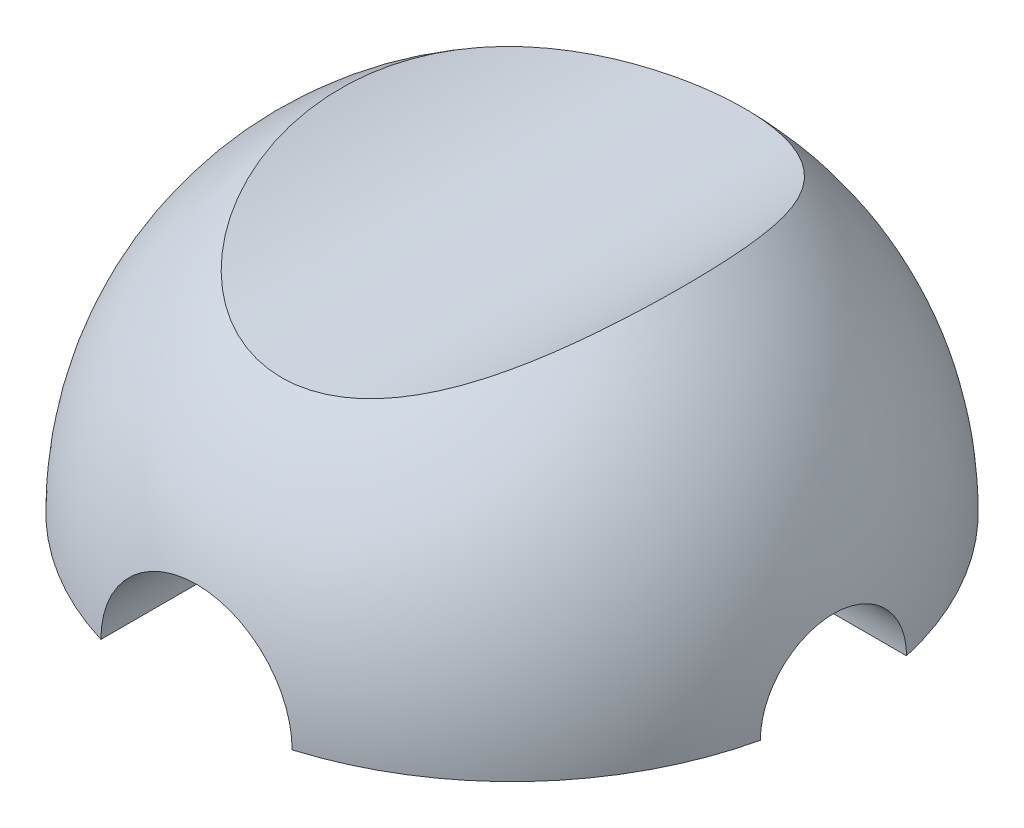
ISO-10303-21;
HEADER;
FILE_DESCRIPTION(('STEP AP214'),'2;1');
FILE_NAME('part.step','',(''),(''),'','','');
FILE_SCHEMA(('AUTOMOTIVE_DESIGN { 1 0 10303 214 1 1 1 1 }'));
ENDSEC;
DATA;
#1=APPLICATION_CONTEXT('core data for automotive mechanical design processes');
#2=APPLICATION_PROTOCOL_DEFINITION('international standard','automotive_design',2000,#1);
#3=PRODUCT_CONTEXT('',#1,'mechanical');
#4=PRODUCT('Part','Part','',(#3));
#5=PRODUCT_RELATED_PRODUCT_CATEGORY('part','',(#4));
#6=PRODUCT_DEFINITION_FORMATION('','',#4);
#7=PRODUCT_DEFINITION_CONTEXT('part definition',#1,'design');
#8=PRODUCT_DEFINITION('design','',#6,#7);
#9=PRODUCT_DEFINITION_SHAPE('','',#8);
#10=(LENGTH_UNIT() NAMED_UNIT(*) SI_UNIT(.MILLI.,.METRE.));
#11=(NAMED_UNIT(*) PLANE_ANGLE_UNIT() SI_UNIT($,.RADIAN.));
#12=(NAMED_UNIT(*) SI_UNIT($,.STERADIAN.) SOLID_ANGLE_UNIT());
#13=UNCERTAINTY_MEASURE_WITH_UNIT(LENGTH_MEASURE(1.E-05),#10,'distance_accuracy_value','');
#14=(GEOMETRIC_REPRESENTATION_CONTEXT(3) GLOBAL_UNCERTAINTY_ASSIGNED_CONTEXT((#13)) GLOBAL_UNIT_ASSIGNED_CONTEXT((#10,
#11,#12)) REPRESENTATION_CONTEXT('',''));
#15=CARTESIAN_POINT('',(0.,0.,0.));
#16=DIRECTION('',(0.,0.,1.));
#17=DIRECTION('',(1.,0.,0.));
#18=AXIS2_PLACEMENT_3D('',#15,#16,#17);
#19=CARTESIAN_POINT('',(-24.1796923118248,0.,-60.8720928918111));
#20=DIRECTION('',(0.,0.,1.));
#21=DIRECTION('',(1.,0.,0.));
#22=AXIS2_PLACEMENT_3D('',#19,#20,#21);
#23=CYLINDRICAL_SURFACE('',#22,11.6016133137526);
#24=CARTESIAN_POINT('',(-24.1796923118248,0.,4.55312467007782));
#25=DIRECTION('',(0.,0.,-1.));
#26=DIRECTION('',(-1.,0.,0.));
#27=AXIS2_PLACEMENT_3D('',#24,#25,#26);
#28=CIRCLE('',#27,11.6016133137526);
#29=CARTESIAN_POINT('',(-12.5780789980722,0.,4.55312467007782));
#30=VERTEX_POINT('',#29);
#31=CARTESIAN_POINT('',(-35.7813056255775,0.,4.55312467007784));
#32=VERTEX_POINT('',#31);
#33=EDGE_CURVE('E160',#30,#32,#28,.F.);
#34=ORIENTED_EDGE('',*,*,#33,.F.);
#35=DIRECTION('',(0.,0.,1.));
#36=VECTOR('',#35,1.);
#37=CARTESIAN_POINT('',(-12.5780789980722,0.,-60.8720928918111));
#38=LINE('',#37,#36);
#39=CARTESIAN_POINT('',(-12.5780789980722,0.,17.4084840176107));
#40=VERTEX_POINT('',#39);
#41=EDGE_CURVE('E153',#30,#40,#38,.T.);
#42=ORIENTED_EDGE('',*,*,#41,.T.);
#43=CARTESIAN_POINT('',(-24.1796923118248,0.,17.4084840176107));
#44=DIRECTION('',(0.,0.,-1.));
#45=DIRECTION('',(-1.,0.,0.));
#46=AXIS2_PLACEMENT_3D('',#43,#44,#45);
#47=CIRCLE('',#46,11.6016133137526);
#48=CARTESIAN_POINT('',(-35.7813056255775,0.,17.4084840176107));
#49=VERTEX_POINT('',#48);
#50=EDGE_CURVE('E59',#49,#40,#47,.T.);
#51=ORIENTED_EDGE('',*,*,#50,.F.);
#52=DIRECTION('',(0.,0.,1.));
#53=VECTOR('',#52,1.);
#54=CARTESIAN_POINT('',(-35.7813056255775,0.,-60.8720928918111));
#55=LINE('',#54,#53);
#56=EDGE_CURVE('E149',#49,#32,#55,.F.);
#57=ORIENTED_EDGE('',*,*,#56,.T.);
#58=EDGE_LOOP('',(#34,#42,#51,#57));
#59=FACE_BOUND('',#58,.T.);
#60=ADVANCED_FACE('F36',(#59),#23,.F.);
#61=CARTESIAN_POINT('',(-24.1796923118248,0.,-46.2973104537));
#62=DIRECTION('',(0.,0.,1.));
#63=DIRECTION('',(1.,0.,0.));
#64=AXIS2_PLACEMENT_3D('',#61,#62,#63);
#65=CIRCLE('',#64,11.6016133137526);
#66=CARTESIAN_POINT('',(-35.7813056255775,0.,-46.2973104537));
#67=VERTEX_POINT('',#66);
#68=CARTESIAN_POINT('',(-12.5780789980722,0.,-46.2973104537));
#69=VERTEX_POINT('',#68);
#70=EDGE_CURVE('E114',#67,#69,#65,.F.);
#71=ORIENTED_EDGE('',*,*,#70,.F.);
#72=CARTESIAN_POINT('',(-35.7813056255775,0.,-59.1526698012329));
#73=VERTEX_POINT('',#72);
#74=EDGE_CURVE('E113',#67,#73,#55,.F.);
#75=ORIENTED_EDGE('',*,*,#74,.T.);
#76=CARTESIAN_POINT('',(-24.1796923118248,0.,-59.1526698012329));
#77=DIRECTION('',(0.,0.,1.));
#78=DIRECTION('',(1.,0.,0.));
#79=AXIS2_PLACEMENT_3D('',#76,#77,#78);
#80=CIRCLE('',#79,11.6016133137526);
#81=CARTESIAN_POINT('',(-12.5780789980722,0.,-59.1526698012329));
#82=VERTEX_POINT('',#81);
#83=EDGE_CURVE('E121',#82,#73,#80,.T.);
#84=ORIENTED_EDGE('',*,*,#83,.F.);
#85=EDGE_CURVE('E45',#82,#69,#38,.T.);
#86=ORIENTED_EDGE('',*,*,#85,.T.);
#87=EDGE_LOOP('',(#71,#75,#84,#86));
#88=FACE_BOUND('',#87,.T.);
#89=ADVANCED_FACE('F202',(#88),#23,.F.);
#90=CARTESIAN_POINT('',(-64.1796923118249,0.,-20.8720928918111));
#91=DIRECTION('',(1.,0.,0.));
#92=DIRECTION('',(0.,0.,-1.));
#93=AXIS2_PLACEMENT_3D('',#90,#91,#92);
#94=CYLINDRICAL_SURFACE('',#93,8.87181817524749);
#95=CARTESIAN_POINT('',(2.32181635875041,0.,-20.8720928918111));
#96=DIRECTION('',(-1.,0.,0.));
#97=DIRECTION('',(0.,0.,1.));
#98=AXIS2_PLACEMENT_3D('',#95,#96,#97);
#99=CIRCLE('',#98,8.87181817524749);
#100=CARTESIAN_POINT('',(2.32181635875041,0.,-29.7439110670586));
#101=VERTEX_POINT('',#100);
#102=CARTESIAN_POINT('',(2.32181635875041,0.,-12.0002747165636));
#103=VERTEX_POINT('',#102);
#104=EDGE_CURVE('E187',#101,#103,#99,.F.);
#105=ORIENTED_EDGE('',*,*,#104,.F.);
#106=DIRECTION('',(1.,0.,0.));
#107=VECTOR('',#106,1.);
#108=CARTESIAN_POINT('',(-64.1796923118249,-2.79318507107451E-13,-29.7439110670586));
#109=LINE('',#108,#107);
#110=CARTESIAN_POINT('',(14.8240362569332,0.,-29.7439110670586));
#111=VERTEX_POINT('',#110);
#112=EDGE_CURVE('E182',#101,#111,#109,.T.);
#113=ORIENTED_EDGE('',*,*,#112,.T.);
#114=CARTESIAN_POINT('',(14.8240362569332,0.,-20.8720928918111));
#115=DIRECTION('',(-1.,0.,0.));
#116=DIRECTION('',(0.,0.,1.));
#117=AXIS2_PLACEMENT_3D('',#114,#115,#116);
#118=CIRCLE('',#117,8.87181817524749);
#119=CARTESIAN_POINT('',(14.8240362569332,0.,-12.0002747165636));
#120=VERTEX_POINT('',#119);
#121=EDGE_CURVE('E123',#120,#111,#118,.T.);
#122=ORIENTED_EDGE('',*,*,#121,.F.);
#123=DIRECTION('',(1.,0.,0.));
#124=VECTOR('',#123,1.);
#125=CARTESIAN_POINT('',(-64.1796923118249,-2.79318507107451E-13,-12.0002747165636));
#126=LINE('',#125,#124);
#127=EDGE_CURVE('E167',#120,#103,#126,.F.);
#128=ORIENTED_EDGE('',*,*,#127,.T.);
#129=EDGE_LOOP('',(#105,#113,#122,#128));
#130=FACE_BOUND('',#129,.T.);
#131=ADVANCED_FACE('F206',(#130),#94,.F.);
#132=CARTESIAN_POINT('',(-50.6812009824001,0.,-20.8720928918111));
#133=DIRECTION('',(1.,0.,0.));
#134=DIRECTION('',(0.,0.,-1.));
#135=AXIS2_PLACEMENT_3D('',#132,#133,#134);
#136=CIRCLE('',#135,8.87181817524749);
#137=CARTESIAN_POINT('',(-50.6812009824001,-2.79318507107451E-13,-12.0002747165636));
#138=VERTEX_POINT('',#137);
#139=CARTESIAN_POINT('',(-50.6812009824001,0.,-29.7439110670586));
#140=VERTEX_POINT('',#139);
#141=EDGE_CURVE('E11',#138,#140,#136,.F.);
#142=ORIENTED_EDGE('',*,*,#141,.F.);
#143=DIRECTION('',(1.,0.,0.));
#144=VECTOR('',#143,1.);
#145=CARTESIAN_POINT('',(-64.1796923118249,-2.79318507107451E-13,-12.0002747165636));
#146=LINE('',#145,#144);
#147=CARTESIAN_POINT('',(-63.1834208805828,0.,-12.0002747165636));
#148=VERTEX_POINT('',#147);
#149=EDGE_CURVE('E119',#138,#148,#146,.F.);
#150=ORIENTED_EDGE('',*,*,#149,.T.);
#151=CARTESIAN_POINT('',(-63.1834208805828,0.,-20.8720928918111));
#152=DIRECTION('',(1.,0.,0.));
#153=DIRECTION('',(0.,0.,-1.));
#154=AXIS2_PLACEMENT_3D('',#151,#152,#153);
#155=CIRCLE('',#154,8.87181817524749);
#156=CARTESIAN_POINT('',(-63.1834208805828,0.,-29.7439110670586));
#157=VERTEX_POINT('',#156);
#158=EDGE_CURVE('E118',#157,#148,#155,.T.);
#159=ORIENTED_EDGE('',*,*,#158,.F.);
#160=DIRECTION('',(1.,0.,0.));
#161=VECTOR('',#160,1.);
#162=CARTESIAN_POINT('',(-64.1796923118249,-2.79318507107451E-13,-29.7439110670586));
#163=LINE('',#162,#161);
#164=EDGE_CURVE('E111',#157,#140,#163,.T.);
#165=ORIENTED_EDGE('',*,*,#164,.T.);
#166=EDGE_LOOP('',(#142,#150,#159,#165));
#167=FACE_BOUND('',#166,.T.);
#168=ADVANCED_FACE('F116',(#167),#94,.F.);
#169=CARTESIAN_POINT('',(-24.1796923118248,0.,-20.8720928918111));
#170=DIRECTION('',(0.,-1.,0.));
#171=DIRECTION('',(0.,0.,1.));
#172=AXIS2_PLACEMENT_3D('',#169,#170,#171);
#173=PLANE('',#172);
#174=ORIENTED_EDGE('',*,*,#112,.F.);
#175=CARTESIAN_POINT('',(-24.1796923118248,0.,-20.8720928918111));
#176=DIRECTION('',(0.,-1.,0.));
#177=DIRECTION('',(1.,0.,0.));
#178=AXIS2_PLACEMENT_3D('',#175,#176,#177);
#179=CIRCLE('',#178,27.94707712);
#180=EDGE_CURVE('E189',#101,#69,#179,.F.);
#181=ORIENTED_EDGE('',*,*,#180,.T.);
#182=ORIENTED_EDGE('',*,*,#85,.F.);
#183=CARTESIAN_POINT('',(-24.1796923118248,0.,-20.8720928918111));
#184=DIRECTION('',(0.,-1.,0.));
#185=DIRECTION('',(0.,0.,1.));
#186=AXIS2_PLACEMENT_3D('',#183,#184,#185);
#187=CIRCLE('',#186,40.);
#188=EDGE_CURVE('E136',#82,#111,#187,.T.);
#189=ORIENTED_EDGE('',*,*,#188,.T.);
#190=EDGE_LOOP('',(#174,#181,#182,#189));
#191=FACE_BOUND('',#190,.T.);
#192=ADVANCED_FACE('F180',(#191),#173,.T.);
#193=ORIENTED_EDGE('',*,*,#74,.F.);
#194=CARTESIAN_POINT('',(-24.1796923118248,0.,-20.8720928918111));
#195=DIRECTION('',(0.,-1.,0.));
#196=DIRECTION('',(1.,0.,0.));
#197=AXIS2_PLACEMENT_3D('',#194,#195,#196);
#198=CIRCLE('',#197,27.94707712);
#199=EDGE_CURVE('E101',#67,#140,#198,.F.);
#200=ORIENTED_EDGE('',*,*,#199,.T.);
#201=ORIENTED_EDGE('',*,*,#164,.F.);
#202=EDGE_CURVE('E170',#157,#73,#187,.T.);
#203=ORIENTED_EDGE('',*,*,#202,.T.);
#204=EDGE_LOOP('',(#193,#200,#201,#203));
#205=FACE_BOUND('',#204,.T.);
#206=ADVANCED_FACE('F109',(#205),#173,.T.);
#207=ORIENTED_EDGE('',*,*,#41,.F.);
#208=CARTESIAN_POINT('',(-24.1796923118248,0.,-20.8720928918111));
#209=DIRECTION('',(0.,-1.,0.));
#210=DIRECTION('',(1.,0.,0.));
#211=AXIS2_PLACEMENT_3D('',#208,#209,#210);
#212=CIRCLE('',#211,27.94707712);
#213=EDGE_CURVE('E191',#30,#103,#212,.F.);
#214=ORIENTED_EDGE('',*,*,#213,.T.);
#215=ORIENTED_EDGE('',*,*,#127,.F.);
#216=EDGE_CURVE('E135',#120,#40,#187,.T.);
#217=ORIENTED_EDGE('',*,*,#216,.T.);
#218=EDGE_LOOP('',(#207,#214,#215,#217));
#219=FACE_BOUND('',#218,.T.);
#220=ADVANCED_FACE('F165',(#219),#173,.T.);
#221=CARTESIAN_POINT('',(-24.1796923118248,0.,-20.8720928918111));
#222=DIRECTION('',(0.,0.,-1.));
#223=DIRECTION('',(-1.,0.,0.));
#224=AXIS2_PLACEMENT_3D('',#221,#222,#223);
#225=SPHERICAL_SURFACE('',#224,40.);
#226=ORIENTED_EDGE('',*,*,#216,.F.);
#227=ORIENTED_EDGE('',*,*,#121,.T.);
#228=ORIENTED_EDGE('',*,*,#188,.F.);
#229=ORIENTED_EDGE('',*,*,#83,.T.);
#230=ORIENTED_EDGE('',*,*,#202,.F.);
#231=ORIENTED_EDGE('',*,*,#158,.T.);
#232=EDGE_CURVE('E174',#49,#148,#187,.T.);
#233=ORIENTED_EDGE('',*,*,#232,.F.);
#234=ORIENTED_EDGE('',*,*,#50,.T.);
#235=EDGE_LOOP('',(#226,#227,#228,#229,#230,#231,#233,#234));
#236=FACE_BOUND('',#235,.T.);
#237=CARTESIAN_POINT('',(-3.37883012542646,34.1661255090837,-20.8720928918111));
#238=CARTESIAN_POINT('',(-3.37882887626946,34.166122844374,-19.9619423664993));
#239=CARTESIAN_POINT('',(-3.40778227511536,34.1473641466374,-19.0517512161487));
#240=CARTESIAN_POINT('',(-3.52403356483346,34.0727942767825,-17.2365634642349));
#241=CARTESIAN_POINT('',(-3.61133595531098,34.0169802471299,-16.3315672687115));
#242=CARTESIAN_POINT('',(-3.84574669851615,33.8696364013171,-14.5310297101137));
#243=CARTESIAN_POINT('',(-3.99293363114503,33.7780596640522,-13.6355023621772));
#244=CARTESIAN_POINT('',(-4.34925660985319,33.5616359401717,-11.8609281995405));
#245=CARTESIAN_POINT('',(-4.55838997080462,33.4367903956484,-10.9818806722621));
#246=CARTESIAN_POINT('',(-5.04307878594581,33.156436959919,-9.24101190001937));
#247=CARTESIAN_POINT('',(-5.31904944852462,33.0007385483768,-8.37933631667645));
#248=CARTESIAN_POINT('',(-5.9404342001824,32.6639118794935,-6.68618698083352));
#249=CARTESIAN_POINT('',(-6.28586103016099,32.4827789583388,-5.85471880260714));
#250=CARTESIAN_POINT('',(-7.04939416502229,32.1016227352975,-4.23247061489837));
#251=CARTESIAN_POINT('',(-7.46734426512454,31.9016404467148,-3.44160779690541));
#252=CARTESIAN_POINT('',(-8.38041382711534,31.4900851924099,-1.90912717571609));
#253=CARTESIAN_POINT('',(-8.87548376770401,31.2785197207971,-1.16747820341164));
#254=CARTESIAN_POINT('',(-9.74824696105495,30.9316641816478,-0.00827610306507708));
#255=CARTESIAN_POINT('',(-10.1017621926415,30.7970614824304,0.427811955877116));
#256=CARTESIAN_POINT('',(-10.8413312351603,30.5295890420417,1.27209176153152));
#257=CARTESIAN_POINT('',(-11.2273805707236,30.3967190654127,1.68028733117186));
#258=CARTESIAN_POINT('',(-12.0316575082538,30.1357729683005,2.46441455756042));
#259=CARTESIAN_POINT('',(-12.449849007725,30.0076917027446,2.84038143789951));
#260=CARTESIAN_POINT('',(-13.3182474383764,29.7593121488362,3.55625692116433));
#261=CARTESIAN_POINT('',(-13.7684500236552,29.6390128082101,3.89617040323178));
#262=CARTESIAN_POINT('',(-14.6243214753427,29.4280109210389,4.48378656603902));
#263=CARTESIAN_POINT('',(-15.0254512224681,29.3356651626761,4.73751749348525));
#264=CARTESIAN_POINT('',(-15.8479157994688,29.1607032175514,5.21369375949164));
#265=CARTESIAN_POINT('',(-16.2692486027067,29.0780860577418,5.4361422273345));
#266=CARTESIAN_POINT('',(-17.1301419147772,28.9244837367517,5.84702788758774));
#267=CARTESIAN_POINT('',(-17.5696980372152,28.8534957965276,6.03547320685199));
#268=CARTESIAN_POINT('',(-18.4646492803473,28.7248647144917,6.37591187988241));
#269=CARTESIAN_POINT('',(-18.9200445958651,28.6672217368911,6.5279047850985));
#270=CARTESIAN_POINT('',(-19.8461016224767,28.5664991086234,6.7939695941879));
#271=CARTESIAN_POINT('',(-20.3168328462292,28.523500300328,6.90783093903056));
#272=CARTESIAN_POINT('',(-21.2675354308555,28.4536613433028,7.09475183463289));
#273=CARTESIAN_POINT('',(-21.7475068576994,28.4268213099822,7.16781109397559));
#274=CARTESIAN_POINT('',(-22.7125094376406,28.3900235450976,7.27199610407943));
#275=CARTESIAN_POINT('',(-23.1975393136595,28.380061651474,7.30313219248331));
#276=CARTESIAN_POINT('',(-24.1684966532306,28.3772326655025,7.32308915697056));
#277=CARTESIAN_POINT('',(-24.6544240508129,28.3843643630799,7.31191302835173));
#278=CARTESIAN_POINT('',(-25.578269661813,28.4139956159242,7.2505527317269));
#279=CARTESIAN_POINT('',(-26.0164864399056,28.4350187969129,7.20405723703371));
#280=CARTESIAN_POINT('',(-26.8871048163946,28.4903492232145,7.07722138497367));
#281=CARTESIAN_POINT('',(-27.3195068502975,28.5246554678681,6.99688357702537));
#282=CARTESIAN_POINT('',(-28.175705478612,28.6057102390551,6.80351882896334));
#283=CARTESIAN_POINT('',(-28.5995023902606,28.6524583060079,6.69049309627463));
#284=CARTESIAN_POINT('',(-29.436063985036,28.7573268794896,6.43323589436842));
#285=CARTESIAN_POINT('',(-29.8488281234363,28.8154479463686,6.28900288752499));
#286=CARTESIAN_POINT('',(-30.674375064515,28.9438678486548,5.9659146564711));
#287=CARTESIAN_POINT('',(-31.0867257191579,29.0145000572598,5.78608960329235));
#288=CARTESIAN_POINT('',(-31.8955396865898,29.1650711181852,5.39711691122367));
#289=CARTESIAN_POINT('',(-32.2920031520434,29.2450098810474,5.18796955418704));
#290=CARTESIAN_POINT('',(-33.0677393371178,29.4126731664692,4.74244240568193));
#291=CARTESIAN_POINT('',(-33.4470066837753,29.5004000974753,4.50605418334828));
#292=CARTESIAN_POINT('',(-34.1872175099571,29.6820688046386,4.00825119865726));
#293=CARTESIAN_POINT('',(-34.5481574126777,29.7760117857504,3.7468315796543));
#294=CARTESIAN_POINT('',(-35.3981276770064,30.008903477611,3.0868153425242));
#295=CARTESIAN_POINT('',(-35.877532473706,30.1502306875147,2.67660308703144));
#296=CARTESIAN_POINT('',(-36.7969206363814,30.4381666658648,1.81581514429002));
#297=CARTESIAN_POINT('',(-37.236891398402,30.5847771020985,1.36522664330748));
#298=CARTESIAN_POINT('',(-38.0778653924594,30.8796916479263,0.428237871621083));
#299=CARTESIAN_POINT('',(-38.4788033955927,31.0279981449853,-0.0582200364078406));
#300=CARTESIAN_POINT('',(-39.2413209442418,31.3226223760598,-1.06150164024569));
#301=CARTESIAN_POINT('',(-39.6028995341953,31.4689400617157,-1.57832607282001));
#302=CARTESIAN_POINT('',(-40.3866037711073,31.7981407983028,-2.79144395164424));
#303=CARTESIAN_POINT('',(-40.7960118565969,31.9793653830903,-3.49642518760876));
#304=CARTESIAN_POINT('',(-41.5532427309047,32.327849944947,-4.94204341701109));
#305=CARTESIAN_POINT('',(-41.9010480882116,32.495105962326,-5.68269042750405));
#306=CARTESIAN_POINT('',(-42.5376517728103,32.8110366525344,-7.19298744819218));
#307=CARTESIAN_POINT('',(-42.8264286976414,32.9597045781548,-7.96264785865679));
#308=CARTESIAN_POINT('',(-43.3472419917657,33.2345936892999,-9.52469051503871));
#309=CARTESIAN_POINT('',(-43.5792821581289,33.3608163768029,-10.3170712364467));
#310=CARTESIAN_POINT('',(-43.9921270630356,33.5896681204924,-11.9322451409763));
#311=CARTESIAN_POINT('',(-44.1720457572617,33.691884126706,-12.7553226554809));
#312=CARTESIAN_POINT('',(-44.4774272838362,33.8676943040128,-14.4144973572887));
#313=CARTESIAN_POINT('',(-44.6028896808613,33.9412882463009,-15.2505946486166));
#314=CARTESIAN_POINT('',(-44.8007238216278,34.0582204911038,-16.9312646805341));
#315=CARTESIAN_POINT('',(-44.8730871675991,34.1015540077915,-17.7758387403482));
#316=CARTESIAN_POINT('',(-44.965490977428,34.1570082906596,-19.4688828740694));
#317=CARTESIAN_POINT('',(-44.9855281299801,34.1691270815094,-20.3173531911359));
#318=CARTESIAN_POINT('',(-44.97258418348,34.1613173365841,-22.1429498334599));
#319=CARTESIAN_POINT('',(-44.931072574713,34.1362322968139,-23.1200095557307));
#320=CARTESIAN_POINT('',(-44.7782641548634,34.0449462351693,-25.066874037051));
#321=CARTESIAN_POINT('',(-44.6669563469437,33.978738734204,-26.0366776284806));
#322=CARTESIAN_POINT('',(-44.3729157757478,33.8071339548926,-27.9620338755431));
#323=CARTESIAN_POINT('',(-44.1901754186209,33.7017325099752,-28.9175850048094));
#324=CARTESIAN_POINT('',(-43.7507428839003,33.4549375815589,-30.8066968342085));
#325=CARTESIAN_POINT('',(-43.494068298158,33.3135526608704,-31.740262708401));
#326=CARTESIAN_POINT('',(-42.9597094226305,33.0292899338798,-33.402191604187));
#327=CARTESIAN_POINT('',(-42.6953319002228,32.8918225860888,-34.1357795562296));
#328=CARTESIAN_POINT('',(-42.1138424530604,32.599399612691,-35.578258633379));
#329=CARTESIAN_POINT('',(-41.7967318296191,32.4444444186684,-36.287150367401));
#330=CARTESIAN_POINT('',(-41.1080288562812,32.1210263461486,-37.6737543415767));
#331=CARTESIAN_POINT('',(-40.7365005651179,31.9525794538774,-38.35150202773));
#332=CARTESIAN_POINT('',(-39.9366521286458,31.6065690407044,-39.670156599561));
#333=CARTESIAN_POINT('',(-39.5083467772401,31.4290079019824,-40.3110730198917));
#334=CARTESIAN_POINT('',(-38.6999309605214,31.1119539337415,-41.4044207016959));
#335=CARTESIAN_POINT('',(-38.3318357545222,30.9732285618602,-41.8659798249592));
#336=CARTESIAN_POINT('',(-37.5608116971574,30.6963344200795,-42.7592558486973));
#337=CARTESIAN_POINT('',(-37.1578851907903,30.5581656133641,-43.1909747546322));
#338=CARTESIAN_POINT('',(-36.3174728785,30.2855455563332,-44.0200196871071));
#339=CARTESIAN_POINT('',(-35.8800195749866,30.1510909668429,-44.4173773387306));
#340=CARTESIAN_POINT('',(-35.1983679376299,29.9546670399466,-44.9842973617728));
#341=CARTESIAN_POINT('',(-34.9669126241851,29.8900705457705,-45.168412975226));
#342=CARTESIAN_POINT('',(-34.4955533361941,29.7630355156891,-45.5264305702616));
#343=CARTESIAN_POINT('',(-34.2556471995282,29.7005975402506,-45.7003299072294));
#344=CARTESIAN_POINT('',(-33.6118895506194,29.5393302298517,-46.1447562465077));
#345=CARTESIAN_POINT('',(-33.2011022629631,29.4427009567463,-46.4061390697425));
#346=CARTESIAN_POINT('',(-32.3589269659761,29.258526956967,-46.8967866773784));
#347=CARTESIAN_POINT('',(-31.9275430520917,29.1709804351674,-47.1260578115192));
#348=CARTESIAN_POINT('',(-31.0460013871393,29.0069676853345,-47.5497129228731));
#349=CARTESIAN_POINT('',(-30.595847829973,28.9304989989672,-47.7441046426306));
#350=CARTESIAN_POINT('',(-29.6791240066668,28.7905417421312,-48.0953696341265));
#351=CARTESIAN_POINT('',(-29.2125535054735,28.7270533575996,-48.2522423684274));
#352=CARTESIAN_POINT('',(-28.2630203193,28.6144336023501,-48.5269229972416));
#353=CARTESIAN_POINT('',(-27.7799716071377,28.5653970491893,-48.6444735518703));
#354=CARTESIAN_POINT('',(-26.8040727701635,28.4837018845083,-48.8370778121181));
#355=CARTESIAN_POINT('',(-26.3112225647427,28.4510434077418,-48.9121311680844));
#356=CARTESIAN_POINT('',(-25.3201602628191,28.4031714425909,-49.0182831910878));
#357=CARTESIAN_POINT('',(-24.821950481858,28.387950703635,-49.0494001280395));
#358=CARTESIAN_POINT('',(-23.8245386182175,28.3754853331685,-49.0670297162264));
#359=CARTESIAN_POINT('',(-23.3253366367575,28.3782389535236,-49.0535467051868));
#360=CARTESIAN_POINT('',(-22.3841339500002,28.4004406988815,-48.9859528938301));
#361=CARTESIAN_POINT('',(-21.9417570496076,28.4180609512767,-48.9363688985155));
#362=CARTESIAN_POINT('',(-21.0631229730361,28.4672117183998,-48.8024151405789));
#363=CARTESIAN_POINT('',(-20.6268652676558,28.4987410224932,-48.7180484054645));
#364=CARTESIAN_POINT('',(-19.7634759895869,28.5749912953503,-48.5156267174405));
#365=CARTESIAN_POINT('',(-19.3363436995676,28.619711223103,-48.3975744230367));
#366=CARTESIAN_POINT('',(-18.4938161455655,28.7213412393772,-48.1292648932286));
#367=CARTESIAN_POINT('',(-18.0784213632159,28.7782518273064,-47.9790063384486));
#368=CARTESIAN_POINT('',(-17.2584774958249,28.9035180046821,-47.6467932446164));
#369=CARTESIAN_POINT('',(-16.8540380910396,28.9719592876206,-47.4646009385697));
#370=CARTESIAN_POINT('',(-16.0613079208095,29.118544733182,-47.0713930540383));
#371=CARTESIAN_POINT('',(-15.6730167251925,29.1966886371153,-46.8603782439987));
#372=CARTESIAN_POINT('',(-14.9139124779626,29.3611813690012,-46.4116222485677));
#373=CARTESIAN_POINT('',(-14.5431038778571,29.4475322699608,-46.1738743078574));
#374=CARTESIAN_POINT('',(-13.8200536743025,29.6268707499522,-45.6738623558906));
#375=CARTESIAN_POINT('',(-13.4678157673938,29.7198596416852,-45.4115934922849));
#376=CARTESIAN_POINT('',(-12.640303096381,29.9506027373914,-44.7510978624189));
#377=CARTESIAN_POINT('',(-12.1746660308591,30.0909130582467,-44.3416341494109));
#378=CARTESIAN_POINT('',(-11.2828490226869,30.3774904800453,-43.4836656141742));
#379=CARTESIAN_POINT('',(-10.8566818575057,30.5237594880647,-43.0351482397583));
#380=CARTESIAN_POINT('',(-10.0430890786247,30.8185745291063,-42.1035956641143));
#381=CARTESIAN_POINT('',(-9.65573189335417,30.9671240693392,-41.6205019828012));
#382=CARTESIAN_POINT('',(-8.91989937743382,31.2627008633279,-40.6252507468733));
#383=CARTESIAN_POINT('',(-8.57142505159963,31.4097280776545,-40.1130924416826));
#384=CARTESIAN_POINT('',(-7.80811618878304,31.7448180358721,-38.8981448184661));
#385=CARTESIAN_POINT('',(-7.40705417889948,31.9311849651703,-38.1862107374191));
#386=CARTESIAN_POINT('',(-6.66716558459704,32.2897332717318,-36.7272549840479));
#387=CARTESIAN_POINT('',(-6.32835876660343,32.4619101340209,-35.9802222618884));
#388=CARTESIAN_POINT('',(-5.70976599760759,32.7870804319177,-34.4577836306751));
#389=CARTESIAN_POINT('',(-5.43000528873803,32.9400656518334,-33.6823657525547));
#390=CARTESIAN_POINT('',(-4.92675491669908,33.2226842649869,-32.1095030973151));
#391=CARTESIAN_POINT('',(-4.70325958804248,33.3523200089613,-31.31206054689));
#392=CARTESIAN_POINT('',(-4.3156876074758,33.5816747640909,-29.7238572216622));
#393=CARTESIAN_POINT('',(-4.15006615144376,33.6821569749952,-28.9335815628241));
#394=CARTESIAN_POINT('',(-3.8675287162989,33.8559370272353,-27.3414630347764));
#395=CARTESIAN_POINT('',(-3.75061185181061,33.9292353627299,-26.5396203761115));
#396=CARTESIAN_POINT('',(-3.56415207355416,34.047084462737,-24.928713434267));
#397=CARTESIAN_POINT('',(-3.49458904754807,34.09164743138,-24.119652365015));
#398=CARTESIAN_POINT('',(-3.40192732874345,34.1511699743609,-22.4977694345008));
#399=CARTESIAN_POINT('',(-3.37883124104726,34.1661278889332,-21.6849473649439));
#400=CARTESIAN_POINT('',(-3.37883012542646,34.1661255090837,-20.8720928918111));
#401=B_SPLINE_CURVE_WITH_KNOTS('',3,(#237,#238,#239,#240,#241,#242,#243,#244,#245,#246,#247,
#248,#249,#250,#251,#252,#253,#254,#255,#256,#257,#258,#259,#260,#261,#262,#263,#264,#265,#266,
#267,#268,#269,#270,#271,#272,#273,#274,#275,#276,#277,#278,#279,#280,#281,#282,#283,#284,#285,
#286,#287,#288,#289,#290,#291,#292,#293,#294,#295,#296,#297,#298,#299,#300,#301,#302,#303,#304,
#305,#306,#307,#308,#309,#310,#311,#312,#313,#314,#315,#316,#317,#318,#319,#320,#321,#322,#323,
#324,#325,#326,#327,#328,#329,#330,#331,#332,#333,#334,#335,#336,#337,#338,#339,#340,#341,#342,
#343,#344,#345,#346,#347,#348,#349,#350,#351,#352,#353,#354,#355,#356,#357,#358,#359,#360,#361,
#362,#363,#364,#365,#366,#367,#368,#369,#370,#371,#372,#373,#374,#375,#376,#377,#378,#379,#380,
#381,#382,#383,#384,#385,#386,#387,#388,#389,#390,#391,#392,#393,#394,#395,#396,#397,#398,#399,
#400),.UNSPECIFIED.,.T.,.F.,(4,2,2,2,2,2,2,2,2,2,2,2,2,2,2,2,2,2,2,2,2,2,2,2,2,2,2,2,2,2,2,2,2,
2,2,2,2,2,2,2,2,2,2,2,2,2,2,2,2,2,2,2,2,2,2,2,2,2,2,2,2,2,2,2,2,2,2,2,2,2,2,2,2,2,2,2,2,2,2,2,2,
4),(0.,2.72986531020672,5.45994115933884,8.19361100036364,10.9271623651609,13.6781515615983,
16.4296458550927,19.1752857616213,21.9191698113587,23.6496671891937,25.3799269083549,
27.1082708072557,28.8363805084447,30.2855886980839,31.7346518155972,33.1833681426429,
34.6321022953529,36.0887091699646,37.545326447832,39.001584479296,40.4577394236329,
41.7797387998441,43.1016386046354,44.4234895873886,45.7454057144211,47.1101246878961,
48.4748305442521,49.8399599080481,51.2053546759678,53.1422894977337,55.0798412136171,
57.020577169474,58.9613602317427,61.4632420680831,63.9658307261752,66.4693251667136,
68.972652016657,71.516325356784,74.0600190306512,76.6041149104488,79.1483717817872,
82.0797343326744,85.011558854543,87.943695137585,90.8751343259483,93.2483901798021,
95.621587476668,97.9920132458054,100.361822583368,102.179585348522,103.997225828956,
105.813175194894,106.721096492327,107.629251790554,109.116867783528,110.604189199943,
112.091180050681,113.578192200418,115.074753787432,116.571327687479,118.067279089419,
119.563085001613,120.89797134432,122.232741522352,123.567406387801,124.902125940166,
126.247241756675,127.592321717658,128.937742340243,130.283429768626,132.187846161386,
134.092876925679,136.001209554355,137.909591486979,140.42034070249,142.931885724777,
145.444502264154,147.956865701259,150.395849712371,152.834789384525,155.27269253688,
157.710732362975),.UNSPECIFIED.);
#402=CARTESIAN_POINT('',(-3.37883012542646,34.1661255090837,-20.8720928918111));
#403=VERTEX_POINT('',#402);
#404=EDGE_CURVE('E130',#403,#403,#401,.T.);
#405=ORIENTED_EDGE('',*,*,#404,.T.);
#406=EDGE_LOOP('',(#405));
#407=FACE_BOUND('',#406,.T.);
#408=ADVANCED_FACE('F38',(#236,#407),#225,.T.);
#409=ORIENTED_EDGE('',*,*,#149,.F.);
#410=CARTESIAN_POINT('',(-24.1796923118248,0.,-20.8720928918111));
#411=DIRECTION('',(0.,-1.,0.));
#412=DIRECTION('',(1.,0.,0.));
#413=AXIS2_PLACEMENT_3D('',#410,#411,#412);
#414=CIRCLE('',#413,27.94707712);
#415=EDGE_CURVE('E51',#138,#32,#414,.F.);
#416=ORIENTED_EDGE('',*,*,#415,.T.);
#417=ORIENTED_EDGE('',*,*,#56,.F.);
#418=ORIENTED_EDGE('',*,*,#232,.T.);
#419=EDGE_LOOP('',(#409,#416,#417,#418));
#420=FACE_BOUND('',#419,.T.);
#421=ADVANCED_FACE('F142',(#420),#173,.T.);
#422=CARTESIAN_POINT('',(-44.9805544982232,34.1661255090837,-60.8720928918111));
#423=CARTESIAN_POINT('',(-32.600950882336,26.7052420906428,-60.8720928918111));
#424=CARTESIAN_POINT('',(-15.7179763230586,26.1974392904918,-60.8720928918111));
#425=CARTESIAN_POINT('',(-3.37883012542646,34.1661255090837,-60.8720928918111));
#426=B_SPLINE_CURVE_WITH_KNOTS('',3,(#422,#423,#424,#425),.UNSPECIFIED.,.F.,.F.,(4,4),(0.,1.),.UNSPECIFIED.);
#427=DIRECTION('',(0.,0.,1.));
#428=VECTOR('',#427,1.);
#429=SURFACE_OF_LINEAR_EXTRUSION('',#426,#428);
#430=ORIENTED_EDGE('',*,*,#404,.F.);
#431=EDGE_LOOP('',(#430));
#432=FACE_BOUND('',#431,.T.);
#433=ADVANCED_FACE('F138',(#432),#429,.F.);
#434=CARTESIAN_POINT('',(-24.1796923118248,-1.6884588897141E-13,-20.8720928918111));
#435=DIRECTION('',(0.,0.,-1.));
#436=DIRECTION('',(-1.,0.,0.));
#437=AXIS2_PLACEMENT_3D('',#434,#435,#436);
#438=SPHERICAL_SURFACE('',#437,27.94707712);
#439=ORIENTED_EDGE('',*,*,#104,.T.);
#440=ORIENTED_EDGE('',*,*,#213,.F.);
#441=ORIENTED_EDGE('',*,*,#33,.T.);
#442=ORIENTED_EDGE('',*,*,#415,.F.);
#443=ORIENTED_EDGE('',*,*,#141,.T.);
#444=ORIENTED_EDGE('',*,*,#199,.F.);
#445=ORIENTED_EDGE('',*,*,#70,.T.);
#446=ORIENTED_EDGE('',*,*,#180,.F.);
#447=EDGE_LOOP('',(#439,#440,#441,#442,#443,#444,#445,#446));
#448=FACE_BOUND('',#447,.T.);
#449=ADVANCED_FACE('F100',(#448),#438,.F.);
#450=CLOSED_SHELL('',(#60,#89,#131,#168,#192,#206,#220,#408,#421,#433,#449));
#451=MANIFOLD_SOLID_BREP('B2',#450);
#452=ADVANCED_BREP_SHAPE_REPRESENTATION('',(#18,#451),#14);
#453=SHAPE_DEFINITION_REPRESENTATION(#9,#452);
ENDSEC;
END-ISO-10303-21;
